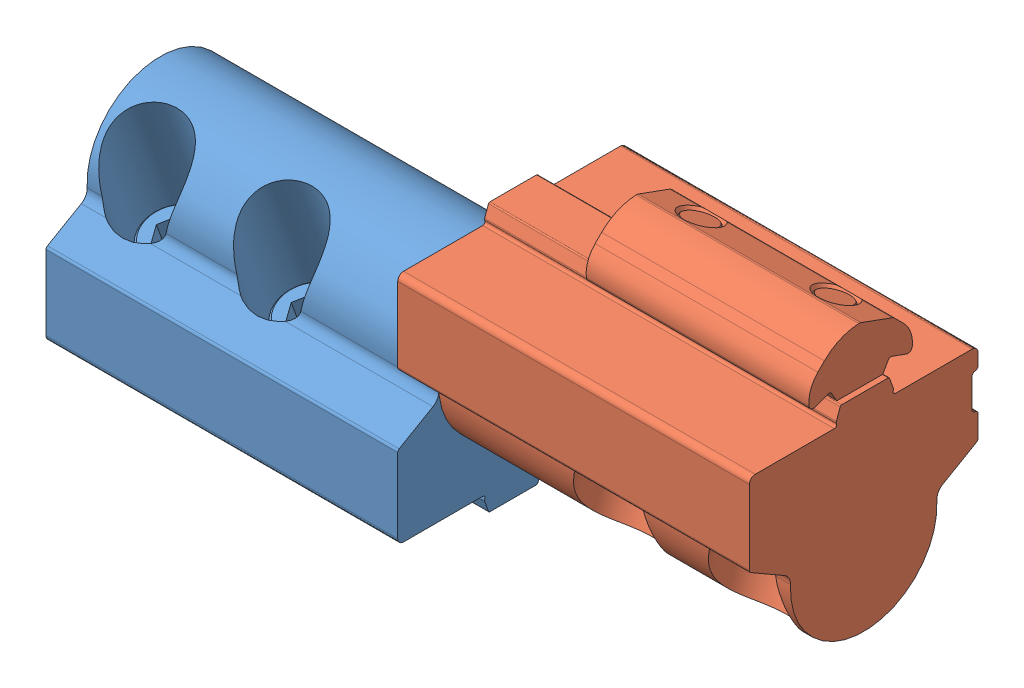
SolidWorks assembly 40mm RH Inline Pivot Kit.SLDASM, configuration Standard (file format 13000). Lengths in mm.
Overall size (120 65.88 39).
2 component instances, 2 part files, 2 mates.
Components (placement in the parent):
- Inline Pivot RH Bushing-1: Inline Pivot RH Bushing.SLDPRT [Default] at (-29.4609 10.5037 17.6366) size (60.85 45.44 39)
- Inline Pivot RH Pin-1: Inline Pivot RH Pin.SLDPRT [Default] at (-29.9609 10.5037 17.6366) size (79.05 45.44 39)
Mates (geometry in assembly coordinates):
- Concentric1: concentric: cylinder of Inline Pivot RH Bushing-1 through (-29.4609 30.5037 17.6366) axis (1 0 0) radius 4.7625; cylinder of Inline Pivot RH Pin-1 through (-49.0109 30.5037 17.6366) axis (-1 0 0) radius 4.7625
- Coincident1: coincident anti-aligned: plane of Inline Pivot RH Bushing-1 through (-29.9609 10.1037 22.6366) normal (1 0 0); plane of Inline Pivot RH Pin-1 through (-29.9609 50.9037 22.6366) normal (-1 0 0)
